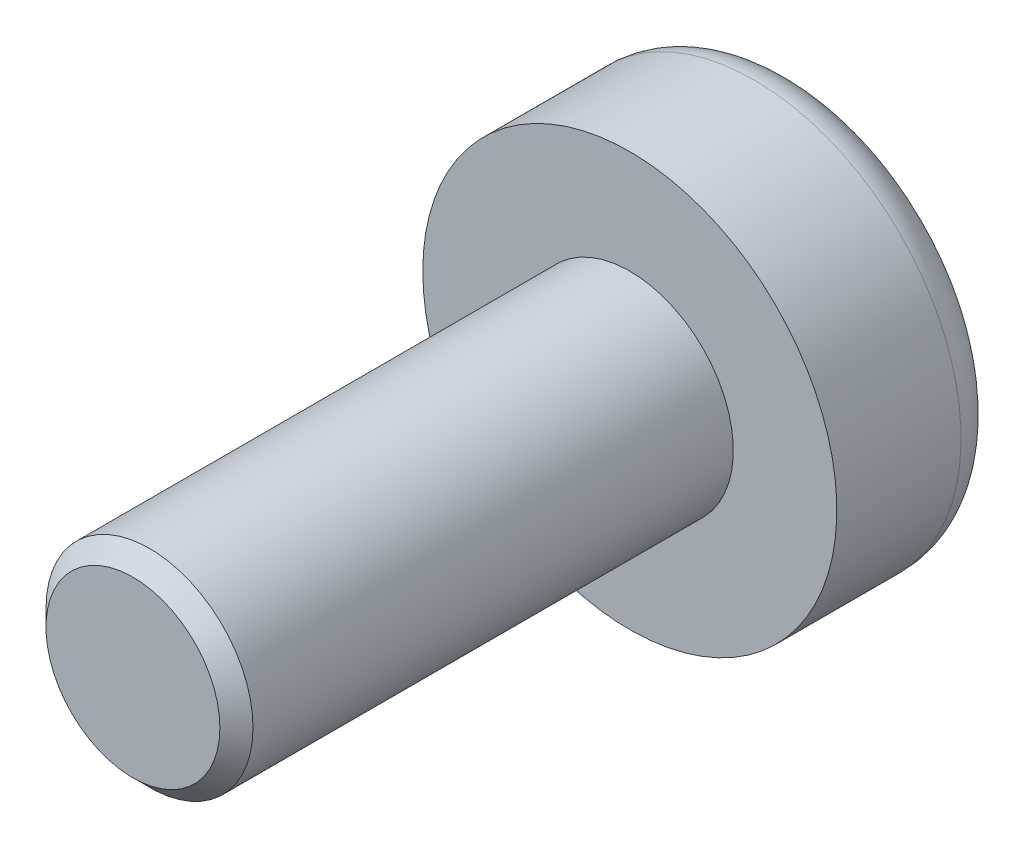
ISO-10303-21;
HEADER;
FILE_DESCRIPTION(('STEP AP214'),'2;1');
FILE_NAME('part.step','',(''),(''),'','','');
FILE_SCHEMA(('AUTOMOTIVE_DESIGN { 1 0 10303 214 1 1 1 1 }'));
ENDSEC;
DATA;
#1=APPLICATION_CONTEXT('core data for automotive mechanical design processes');
#2=APPLICATION_PROTOCOL_DEFINITION('international standard','automotive_design',2000,#1);
#3=PRODUCT_CONTEXT('',#1,'mechanical');
#4=PRODUCT('Part','Part','',(#3));
#5=PRODUCT_RELATED_PRODUCT_CATEGORY('part','',(#4));
#6=PRODUCT_DEFINITION_FORMATION('','',#4);
#7=PRODUCT_DEFINITION_CONTEXT('part definition',#1,'design');
#8=PRODUCT_DEFINITION('design','',#6,#7);
#9=PRODUCT_DEFINITION_SHAPE('','',#8);
#10=(LENGTH_UNIT() NAMED_UNIT(*) SI_UNIT(.MILLI.,.METRE.));
#11=(NAMED_UNIT(*) PLANE_ANGLE_UNIT() SI_UNIT($,.RADIAN.));
#12=(NAMED_UNIT(*) SI_UNIT($,.STERADIAN.) SOLID_ANGLE_UNIT());
#13=UNCERTAINTY_MEASURE_WITH_UNIT(LENGTH_MEASURE(1.E-05),#10,'distance_accuracy_value','');
#14=(GEOMETRIC_REPRESENTATION_CONTEXT(3) GLOBAL_UNCERTAINTY_ASSIGNED_CONTEXT((#13)) GLOBAL_UNIT_ASSIGNED_CONTEXT((#10,
#11,#12)) REPRESENTATION_CONTEXT('',''));
#15=CARTESIAN_POINT('',(0.,0.,0.));
#16=DIRECTION('',(0.,0.,1.));
#17=DIRECTION('',(1.,0.,0.));
#18=AXIS2_PLACEMENT_3D('',#15,#16,#17);
#19=CARTESIAN_POINT('',(0.,0.,6.));
#20=DIRECTION('',(0.,0.,-1.));
#21=DIRECTION('',(-1.,0.,0.));
#22=AXIS2_PLACEMENT_3D('',#19,#20,#21);
#23=CYLINDRICAL_SURFACE('',#22,1.25);
#24=CARTESIAN_POINT('',(0.,0.,5.8));
#25=DIRECTION('',(0.,0.,1.));
#26=DIRECTION('',(1.,0.,0.));
#27=AXIS2_PLACEMENT_3D('',#24,#25,#26);
#28=CIRCLE('',#27,1.25);
#29=CARTESIAN_POINT('',(1.25,0.,5.8));
#30=VERTEX_POINT('',#29);
#31=EDGE_CURVE('E228',#30,#30,#28,.F.);
#32=ORIENTED_EDGE('',*,*,#31,.T.);
#33=EDGE_LOOP('',(#32));
#34=FACE_BOUND('',#33,.T.);
#35=CARTESIAN_POINT('',(0.,0.,0.));
#36=DIRECTION('',(0.,0.,-1.));
#37=DIRECTION('',(-1.,0.,0.));
#38=AXIS2_PLACEMENT_3D('',#35,#36,#37);
#39=CIRCLE('',#38,1.25);
#40=CARTESIAN_POINT('',(-1.25,0.,0.));
#41=VERTEX_POINT('',#40);
#42=EDGE_CURVE('E222',#41,#41,#39,.T.);
#43=ORIENTED_EDGE('',*,*,#42,.F.);
#44=EDGE_LOOP('',(#43));
#45=FACE_BOUND('',#44,.T.);
#46=ADVANCED_FACE('F27',(#34,#45),#23,.T.);
#47=CARTESIAN_POINT('',(0.,0.,6.));
#48=DIRECTION('',(0.,0.,1.));
#49=DIRECTION('',(1.,0.,0.));
#50=AXIS2_PLACEMENT_3D('',#47,#48,#49);
#51=PLANE('',#50);
#52=CARTESIAN_POINT('',(0.,0.,6.));
#53=DIRECTION('',(0.,0.,1.));
#54=DIRECTION('',(1.,0.,0.));
#55=AXIS2_PLACEMENT_3D('',#52,#53,#54);
#56=CIRCLE('',#55,1.05);
#57=CARTESIAN_POINT('',(1.05,0.,6.));
#58=VERTEX_POINT('',#57);
#59=EDGE_CURVE('E225',#58,#58,#56,.T.);
#60=ORIENTED_EDGE('',*,*,#59,.T.);
#61=EDGE_LOOP('',(#60));
#62=FACE_BOUND('',#61,.T.);
#63=ADVANCED_FACE('F250',(#62),#51,.T.);
#64=CARTESIAN_POINT('',(0.,0.,6.));
#65=DIRECTION('',(0.,0.,-1.));
#66=DIRECTION('',(-1.,0.,0.));
#67=AXIS2_PLACEMENT_3D('',#64,#65,#66);
#68=CONICAL_SURFACE('',#67,1.05,0.785398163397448);
#69=ORIENTED_EDGE('',*,*,#31,.F.);
#70=EDGE_LOOP('',(#69));
#71=FACE_BOUND('',#70,.T.);
#72=ORIENTED_EDGE('',*,*,#59,.F.);
#73=EDGE_LOOP('',(#72));
#74=FACE_BOUND('',#73,.T.);
#75=ADVANCED_FACE('F255',(#71,#74),#68,.T.);
#76=CARTESIAN_POINT('',(0.,0.,0.));
#77=DIRECTION('',(0.,0.,-1.));
#78=DIRECTION('',(-1.,0.,0.));
#79=AXIS2_PLACEMENT_3D('',#76,#77,#78);
#80=PLANE('',#79);
#81=CARTESIAN_POINT('',(0.,0.,0.));
#82=DIRECTION('',(0.,0.,-1.));
#83=DIRECTION('',(-1.,0.,0.));
#84=AXIS2_PLACEMENT_3D('',#81,#82,#83);
#85=CIRCLE('',#84,2.5);
#86=CARTESIAN_POINT('',(-2.5,0.,0.));
#87=VERTEX_POINT('',#86);
#88=EDGE_CURVE('E201',#87,#87,#85,.T.);
#89=ORIENTED_EDGE('',*,*,#88,.F.);
#90=EDGE_LOOP('',(#89));
#91=FACE_BOUND('',#90,.T.);
#92=ORIENTED_EDGE('',*,*,#42,.T.);
#93=EDGE_LOOP('',(#92));
#94=FACE_BOUND('',#93,.T.);
#95=ADVANCED_FACE('F261',(#91,#94),#80,.F.);
#96=CARTESIAN_POINT('',(0.,0.,-2.));
#97=DIRECTION('',(0.,0.,1.));
#98=DIRECTION('',(1.,0.,0.));
#99=AXIS2_PLACEMENT_3D('',#96,#97,#98);
#100=CYLINDRICAL_SURFACE('',#99,2.5);
#101=CARTESIAN_POINT('',(0.,0.,-1.5));
#102=DIRECTION('',(0.,0.,-1.));
#103=DIRECTION('',(-1.,0.,0.));
#104=AXIS2_PLACEMENT_3D('',#101,#102,#103);
#105=CIRCLE('',#104,2.5);
#106=CARTESIAN_POINT('',(-2.5,0.,-1.5));
#107=VERTEX_POINT('',#106);
#108=EDGE_CURVE('E11',#107,#107,#105,.F.);
#109=ORIENTED_EDGE('',*,*,#108,.T.);
#110=EDGE_LOOP('',(#109));
#111=FACE_BOUND('',#110,.T.);
#112=ORIENTED_EDGE('',*,*,#88,.T.);
#113=EDGE_LOOP('',(#112));
#114=FACE_BOUND('',#113,.T.);
#115=ADVANCED_FACE('F245',(#111,#114),#100,.T.);
#116=CARTESIAN_POINT('',(0.,0.,-2.));
#117=DIRECTION('',(0.,0.,-1.));
#118=DIRECTION('',(-1.,0.,0.));
#119=AXIS2_PLACEMENT_3D('',#116,#117,#118);
#120=PLANE('',#119);
#121=DIRECTION('',(0.,-1.,0.));
#122=VECTOR('',#121,1.);
#123=CARTESIAN_POINT('',(0.2061337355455,1.04072398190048,-2.));
#124=LINE('',#123,#122);
#125=CARTESIAN_POINT('',(0.2061337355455,1.04072398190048,-2.));
#126=VERTEX_POINT('',#125);
#127=CARTESIAN_POINT('',(0.2061337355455,0.206133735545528,-2.));
#128=VERTEX_POINT('',#127);
#129=EDGE_CURVE('E41',#126,#128,#124,.T.);
#130=ORIENTED_EDGE('',*,*,#129,.F.);
#131=DIRECTION('',(1.,0.,0.));
#132=VECTOR('',#131,1.);
#133=CARTESIAN_POINT('',(0.2061337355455,1.04072398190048,-2.));
#134=LINE('',#133,#132);
#135=CARTESIAN_POINT('',(-0.2061337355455,1.04072398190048,-2.));
#136=VERTEX_POINT('',#135);
#137=EDGE_CURVE('E165',#136,#126,#134,.T.);
#138=ORIENTED_EDGE('',*,*,#137,.F.);
#139=DIRECTION('',(0.,1.,0.));
#140=VECTOR('',#139,1.);
#141=CARTESIAN_POINT('',(-0.2061337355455,1.04072398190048,-2.));
#142=LINE('',#141,#140);
#143=CARTESIAN_POINT('',(-0.2061337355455,0.206133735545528,-2.));
#144=VERTEX_POINT('',#143);
#145=EDGE_CURVE('E162',#144,#136,#142,.T.);
#146=ORIENTED_EDGE('',*,*,#145,.F.);
#147=DIRECTION('',(1.,0.,0.));
#148=VECTOR('',#147,1.);
#149=CARTESIAN_POINT('',(-1.12116641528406,0.206133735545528,-2.));
#150=LINE('',#149,#148);
#151=CARTESIAN_POINT('',(-1.12116641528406,0.206133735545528,-2.));
#152=VERTEX_POINT('',#151);
#153=EDGE_CURVE('E159',#152,#144,#150,.T.);
#154=ORIENTED_EDGE('',*,*,#153,.F.);
#155=DIRECTION('',(0.,1.,0.));
#156=VECTOR('',#155,1.);
#157=CARTESIAN_POINT('',(-1.12116641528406,0.206133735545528,-2.));
#158=LINE('',#157,#156);
#159=CARTESIAN_POINT('',(-1.12116641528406,-0.216189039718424,-2.));
#160=VERTEX_POINT('',#159);
#161=EDGE_CURVE('E156',#160,#152,#158,.T.);
#162=ORIENTED_EDGE('',*,*,#161,.F.);
#163=DIRECTION('',(-1.,0.,0.));
#164=VECTOR('',#163,1.);
#165=CARTESIAN_POINT('',(-1.12116641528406,-0.216189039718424,-2.));
#166=LINE('',#165,#164);
#167=CARTESIAN_POINT('',(-0.2061337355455,-0.216189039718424,-2.));
#168=VERTEX_POINT('',#167);
#169=EDGE_CURVE('E153',#168,#160,#166,.T.);
#170=ORIENTED_EDGE('',*,*,#169,.F.);
#171=DIRECTION('',(0.,1.,0.));
#172=VECTOR('',#171,1.);
#173=CARTESIAN_POINT('',(-0.2061337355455,-0.216189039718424,-2.));
#174=LINE('',#173,#172);
#175=CARTESIAN_POINT('',(-0.2061337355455,-1.13122171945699,-2.));
#176=VERTEX_POINT('',#175);
#177=EDGE_CURVE('E150',#176,#168,#174,.T.);
#178=ORIENTED_EDGE('',*,*,#177,.F.);
#179=DIRECTION('',(-1.,0.,0.));
#180=VECTOR('',#179,1.);
#181=CARTESIAN_POINT('',(0.2061337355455,-1.13122171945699,-2.));
#182=LINE('',#181,#180);
#183=CARTESIAN_POINT('',(0.2061337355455,-1.13122171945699,-2.));
#184=VERTEX_POINT('',#183);
#185=EDGE_CURVE('E147',#184,#176,#182,.T.);
#186=ORIENTED_EDGE('',*,*,#185,.F.);
#187=DIRECTION('',(0.,-1.,0.));
#188=VECTOR('',#187,1.);
#189=CARTESIAN_POINT('',(0.2061337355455,-0.216189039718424,-2.));
#190=LINE('',#189,#188);
#191=CARTESIAN_POINT('',(0.2061337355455,-0.216189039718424,-2.));
#192=VERTEX_POINT('',#191);
#193=EDGE_CURVE('E141',#192,#184,#190,.T.);
#194=ORIENTED_EDGE('',*,*,#193,.F.);
#195=DIRECTION('',(-1.,0.,0.));
#196=VECTOR('',#195,1.);
#197=CARTESIAN_POINT('',(1.17144293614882,-0.216189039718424,-2.));
#198=LINE('',#197,#196);
#199=CARTESIAN_POINT('',(1.17144293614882,-0.216189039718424,-2.));
#200=VERTEX_POINT('',#199);
#201=EDGE_CURVE('E139',#200,#192,#198,.T.);
#202=ORIENTED_EDGE('',*,*,#201,.F.);
#203=DIRECTION('',(0.,-1.,0.));
#204=VECTOR('',#203,1.);
#205=CARTESIAN_POINT('',(1.17144293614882,0.206133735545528,-2.));
#206=LINE('',#205,#204);
#207=CARTESIAN_POINT('',(1.17144293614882,0.206133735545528,-2.));
#208=VERTEX_POINT('',#207);
#209=EDGE_CURVE('E120',#208,#200,#206,.T.);
#210=ORIENTED_EDGE('',*,*,#209,.F.);
#211=DIRECTION('',(1.,0.,0.));
#212=VECTOR('',#211,1.);
#213=CARTESIAN_POINT('',(1.17144293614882,0.206133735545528,-2.));
#214=LINE('',#213,#212);
#215=EDGE_CURVE('E131',#128,#208,#214,.T.);
#216=ORIENTED_EDGE('',*,*,#215,.F.);
#217=EDGE_LOOP('',(#130,#138,#146,#154,#162,#170,#178,#186,#194,#202,#210,#216));
#218=FACE_BOUND('',#217,.T.);
#219=CARTESIAN_POINT('',(0.,0.,-2.));
#220=DIRECTION('',(0.,0.,-1.));
#221=DIRECTION('',(-1.,0.,0.));
#222=AXIS2_PLACEMENT_3D('',#219,#220,#221);
#223=CIRCLE('',#222,2.);
#224=CARTESIAN_POINT('',(-2.,0.,-2.));
#225=VERTEX_POINT('',#224);
#226=EDGE_CURVE('E34',#225,#225,#223,.T.);
#227=ORIENTED_EDGE('',*,*,#226,.T.);
#228=EDGE_LOOP('',(#227));
#229=FACE_BOUND('',#228,.T.);
#230=ADVANCED_FACE('F135',(#218,#229),#120,.T.);
#231=CARTESIAN_POINT('',(0.,0.,-1.5));
#232=DIRECTION('',(0.,0.,-1.));
#233=DIRECTION('',(-1.,0.,0.));
#234=AXIS2_PLACEMENT_3D('',#231,#232,#233);
#235=TOROIDAL_SURFACE('',#234,2.,0.5);
#236=ORIENTED_EDGE('',*,*,#108,.F.);
#237=EDGE_LOOP('',(#236));
#238=FACE_BOUND('',#237,.T.);
#239=ORIENTED_EDGE('',*,*,#226,.F.);
#240=EDGE_LOOP('',(#239));
#241=FACE_BOUND('',#240,.T.);
#242=ADVANCED_FACE('F233',(#238,#241),#235,.T.);
#243=CARTESIAN_POINT('',(0.2061337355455,1.04072398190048,-1.5));
#244=DIRECTION('',(1.,0.,0.));
#245=DIRECTION('',(0.,0.,-1.));
#246=AXIS2_PLACEMENT_3D('',#243,#244,#245);
#247=PLANE('',#246);
#248=ORIENTED_EDGE('',*,*,#129,.T.);
#249=DIRECTION('',(0.,0.,-1.));
#250=VECTOR('',#249,1.);
#251=CARTESIAN_POINT('',(0.2061337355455,0.206133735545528,-1.5));
#252=LINE('',#251,#250);
#253=CARTESIAN_POINT('',(0.2061337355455,0.206133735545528,-1.5));
#254=VERTEX_POINT('',#253);
#255=EDGE_CURVE('E128',#254,#128,#252,.T.);
#256=ORIENTED_EDGE('',*,*,#255,.F.);
#257=DIRECTION('',(0.,-1.,0.));
#258=VECTOR('',#257,1.);
#259=CARTESIAN_POINT('',(0.2061337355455,1.04072398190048,-1.5));
#260=LINE('',#259,#258);
#261=CARTESIAN_POINT('',(0.2061337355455,1.04072398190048,-1.5));
#262=VERTEX_POINT('',#261);
#263=EDGE_CURVE('E167',#262,#254,#260,.T.);
#264=ORIENTED_EDGE('',*,*,#263,.F.);
#265=DIRECTION('',(0.,0.,-1.));
#266=VECTOR('',#265,1.);
#267=CARTESIAN_POINT('',(0.2061337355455,1.04072398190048,-1.5));
#268=LINE('',#267,#266);
#269=EDGE_CURVE('E48',#262,#126,#268,.T.);
#270=ORIENTED_EDGE('',*,*,#269,.T.);
#271=EDGE_LOOP('',(#248,#256,#264,#270));
#272=FACE_BOUND('',#271,.T.);
#273=ADVANCED_FACE('F235',(#272),#247,.F.);
#274=CARTESIAN_POINT('',(0.2061337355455,1.04072398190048,-1.5));
#275=DIRECTION('',(0.,1.,0.));
#276=DIRECTION('',(0.,0.,1.));
#277=AXIS2_PLACEMENT_3D('',#274,#275,#276);
#278=PLANE('',#277);
#279=ORIENTED_EDGE('',*,*,#137,.T.);
#280=ORIENTED_EDGE('',*,*,#269,.F.);
#281=DIRECTION('',(1.,0.,0.));
#282=VECTOR('',#281,1.);
#283=CARTESIAN_POINT('',(0.2061337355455,1.04072398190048,-1.5));
#284=LINE('',#283,#282);
#285=CARTESIAN_POINT('',(-0.2061337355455,1.04072398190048,-1.5));
#286=VERTEX_POINT('',#285);
#287=EDGE_CURVE('E197',#286,#262,#284,.T.);
#288=ORIENTED_EDGE('',*,*,#287,.F.);
#289=DIRECTION('',(0.,0.,-1.));
#290=VECTOR('',#289,1.);
#291=CARTESIAN_POINT('',(-0.2061337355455,1.04072398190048,-1.5));
#292=LINE('',#291,#290);
#293=EDGE_CURVE('E202',#286,#136,#292,.T.);
#294=ORIENTED_EDGE('',*,*,#293,.T.);
#295=EDGE_LOOP('',(#279,#280,#288,#294));
#296=FACE_BOUND('',#295,.T.);
#297=ADVANCED_FACE('F243',(#296),#278,.F.);
#298=CARTESIAN_POINT('',(-0.2061337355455,1.04072398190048,-1.5));
#299=DIRECTION('',(-1.,0.,0.));
#300=DIRECTION('',(0.,0.,1.));
#301=AXIS2_PLACEMENT_3D('',#298,#299,#300);
#302=PLANE('',#301);
#303=ORIENTED_EDGE('',*,*,#145,.T.);
#304=ORIENTED_EDGE('',*,*,#293,.F.);
#305=DIRECTION('',(0.,1.,0.));
#306=VECTOR('',#305,1.);
#307=CARTESIAN_POINT('',(-0.2061337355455,1.04072398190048,-1.5));
#308=LINE('',#307,#306);
#309=CARTESIAN_POINT('',(-0.2061337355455,0.206133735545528,-1.5));
#310=VERTEX_POINT('',#309);
#311=EDGE_CURVE('E194',#310,#286,#308,.T.);
#312=ORIENTED_EDGE('',*,*,#311,.F.);
#313=DIRECTION('',(0.,0.,-1.));
#314=VECTOR('',#313,1.);
#315=CARTESIAN_POINT('',(-0.2061337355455,0.206133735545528,-1.5));
#316=LINE('',#315,#314);
#317=EDGE_CURVE('E204',#310,#144,#316,.T.);
#318=ORIENTED_EDGE('',*,*,#317,.T.);
#319=EDGE_LOOP('',(#303,#304,#312,#318));
#320=FACE_BOUND('',#319,.T.);
#321=ADVANCED_FACE('F306',(#320),#302,.F.);
#322=CARTESIAN_POINT('',(-1.12116641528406,0.206133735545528,-1.5));
#323=DIRECTION('',(0.,1.,0.));
#324=DIRECTION('',(-1.,0.,0.));
#325=AXIS2_PLACEMENT_3D('',#322,#323,#324);
#326=PLANE('',#325);
#327=ORIENTED_EDGE('',*,*,#153,.T.);
#328=ORIENTED_EDGE('',*,*,#317,.F.);
#329=DIRECTION('',(1.,0.,0.));
#330=VECTOR('',#329,1.);
#331=CARTESIAN_POINT('',(-1.12116641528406,0.206133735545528,-1.5));
#332=LINE('',#331,#330);
#333=CARTESIAN_POINT('',(-1.12116641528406,0.206133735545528,-1.5));
#334=VERTEX_POINT('',#333);
#335=EDGE_CURVE('E191',#334,#310,#332,.T.);
#336=ORIENTED_EDGE('',*,*,#335,.F.);
#337=DIRECTION('',(0.,0.,-1.));
#338=VECTOR('',#337,1.);
#339=CARTESIAN_POINT('',(-1.12116641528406,0.206133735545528,-1.5));
#340=LINE('',#339,#338);
#341=EDGE_CURVE('E206',#334,#152,#340,.T.);
#342=ORIENTED_EDGE('',*,*,#341,.T.);
#343=EDGE_LOOP('',(#327,#328,#336,#342));
#344=FACE_BOUND('',#343,.T.);
#345=ADVANCED_FACE('F313',(#344),#326,.F.);
#346=CARTESIAN_POINT('',(-1.12116641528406,0.206133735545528,-1.5));
#347=DIRECTION('',(-1.,0.,0.));
#348=DIRECTION('',(0.,0.,1.));
#349=AXIS2_PLACEMENT_3D('',#346,#347,#348);
#350=PLANE('',#349);
#351=ORIENTED_EDGE('',*,*,#161,.T.);
#352=ORIENTED_EDGE('',*,*,#341,.F.);
#353=DIRECTION('',(0.,1.,0.));
#354=VECTOR('',#353,1.);
#355=CARTESIAN_POINT('',(-1.12116641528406,0.206133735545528,-1.5));
#356=LINE('',#355,#354);
#357=CARTESIAN_POINT('',(-1.12116641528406,-0.216189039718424,-1.5));
#358=VERTEX_POINT('',#357);
#359=EDGE_CURVE('E188',#358,#334,#356,.T.);
#360=ORIENTED_EDGE('',*,*,#359,.F.);
#361=DIRECTION('',(0.,0.,-1.));
#362=VECTOR('',#361,1.);
#363=CARTESIAN_POINT('',(-1.12116641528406,-0.216189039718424,-1.5));
#364=LINE('',#363,#362);
#365=EDGE_CURVE('E208',#358,#160,#364,.T.);
#366=ORIENTED_EDGE('',*,*,#365,.T.);
#367=EDGE_LOOP('',(#351,#352,#360,#366));
#368=FACE_BOUND('',#367,.T.);
#369=ADVANCED_FACE('F321',(#368),#350,.F.);
#370=CARTESIAN_POINT('',(-1.12116641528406,-0.216189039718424,-1.5));
#371=DIRECTION('',(0.,-1.,0.));
#372=DIRECTION('',(1.,0.,0.));
#373=AXIS2_PLACEMENT_3D('',#370,#371,#372);
#374=PLANE('',#373);
#375=ORIENTED_EDGE('',*,*,#169,.T.);
#376=ORIENTED_EDGE('',*,*,#365,.F.);
#377=DIRECTION('',(-1.,0.,0.));
#378=VECTOR('',#377,1.);
#379=CARTESIAN_POINT('',(-1.12116641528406,-0.216189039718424,-1.5));
#380=LINE('',#379,#378);
#381=CARTESIAN_POINT('',(-0.2061337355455,-0.216189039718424,-1.5));
#382=VERTEX_POINT('',#381);
#383=EDGE_CURVE('E185',#382,#358,#380,.T.);
#384=ORIENTED_EDGE('',*,*,#383,.F.);
#385=DIRECTION('',(0.,0.,-1.));
#386=VECTOR('',#385,1.);
#387=CARTESIAN_POINT('',(-0.2061337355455,-0.216189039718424,-1.5));
#388=LINE('',#387,#386);
#389=EDGE_CURVE('E210',#382,#168,#388,.T.);
#390=ORIENTED_EDGE('',*,*,#389,.T.);
#391=EDGE_LOOP('',(#375,#376,#384,#390));
#392=FACE_BOUND('',#391,.T.);
#393=ADVANCED_FACE('F329',(#392),#374,.F.);
#394=CARTESIAN_POINT('',(-0.2061337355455,-0.216189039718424,-1.5));
#395=DIRECTION('',(-1.,0.,0.));
#396=DIRECTION('',(0.,0.,1.));
#397=AXIS2_PLACEMENT_3D('',#394,#395,#396);
#398=PLANE('',#397);
#399=ORIENTED_EDGE('',*,*,#177,.T.);
#400=ORIENTED_EDGE('',*,*,#389,.F.);
#401=DIRECTION('',(0.,1.,0.));
#402=VECTOR('',#401,1.);
#403=CARTESIAN_POINT('',(-0.2061337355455,-0.216189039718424,-1.5));
#404=LINE('',#403,#402);
#405=CARTESIAN_POINT('',(-0.2061337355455,-1.13122171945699,-1.5));
#406=VERTEX_POINT('',#405);
#407=EDGE_CURVE('E182',#406,#382,#404,.T.);
#408=ORIENTED_EDGE('',*,*,#407,.F.);
#409=DIRECTION('',(0.,0.,-1.));
#410=VECTOR('',#409,1.);
#411=CARTESIAN_POINT('',(-0.2061337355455,-1.13122171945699,-1.5));
#412=LINE('',#411,#410);
#413=EDGE_CURVE('E212',#406,#176,#412,.T.);
#414=ORIENTED_EDGE('',*,*,#413,.T.);
#415=EDGE_LOOP('',(#399,#400,#408,#414));
#416=FACE_BOUND('',#415,.T.);
#417=ADVANCED_FACE('F337',(#416),#398,.F.);
#418=CARTESIAN_POINT('',(0.2061337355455,-1.13122171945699,-1.5));
#419=DIRECTION('',(0.,-1.,0.));
#420=DIRECTION('',(0.,0.,-1.));
#421=AXIS2_PLACEMENT_3D('',#418,#419,#420);
#422=PLANE('',#421);
#423=ORIENTED_EDGE('',*,*,#185,.T.);
#424=ORIENTED_EDGE('',*,*,#413,.F.);
#425=DIRECTION('',(-1.,0.,0.));
#426=VECTOR('',#425,1.);
#427=CARTESIAN_POINT('',(0.2061337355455,-1.13122171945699,-1.5));
#428=LINE('',#427,#426);
#429=CARTESIAN_POINT('',(0.2061337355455,-1.13122171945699,-1.5));
#430=VERTEX_POINT('',#429);
#431=EDGE_CURVE('E179',#430,#406,#428,.T.);
#432=ORIENTED_EDGE('',*,*,#431,.F.);
#433=DIRECTION('',(0.,0.,-1.));
#434=VECTOR('',#433,1.);
#435=CARTESIAN_POINT('',(0.2061337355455,-1.13122171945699,-1.5));
#436=LINE('',#435,#434);
#437=EDGE_CURVE('E214',#430,#184,#436,.T.);
#438=ORIENTED_EDGE('',*,*,#437,.T.);
#439=EDGE_LOOP('',(#423,#424,#432,#438));
#440=FACE_BOUND('',#439,.T.);
#441=ADVANCED_FACE('F345',(#440),#422,.F.);
#442=CARTESIAN_POINT('',(0.2061337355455,-0.216189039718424,-1.5));
#443=DIRECTION('',(1.,0.,0.));
#444=DIRECTION('',(0.,0.,-1.));
#445=AXIS2_PLACEMENT_3D('',#442,#443,#444);
#446=PLANE('',#445);
#447=ORIENTED_EDGE('',*,*,#193,.T.);
#448=ORIENTED_EDGE('',*,*,#437,.F.);
#449=DIRECTION('',(0.,-1.,0.));
#450=VECTOR('',#449,1.);
#451=CARTESIAN_POINT('',(0.2061337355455,-0.216189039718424,-1.5));
#452=LINE('',#451,#450);
#453=CARTESIAN_POINT('',(0.2061337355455,-0.216189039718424,-1.5));
#454=VERTEX_POINT('',#453);
#455=EDGE_CURVE('E176',#454,#430,#452,.T.);
#456=ORIENTED_EDGE('',*,*,#455,.F.);
#457=DIRECTION('',(0.,0.,-1.));
#458=VECTOR('',#457,1.);
#459=CARTESIAN_POINT('',(0.2061337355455,-0.216189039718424,-1.5));
#460=LINE('',#459,#458);
#461=EDGE_CURVE('E216',#454,#192,#460,.T.);
#462=ORIENTED_EDGE('',*,*,#461,.T.);
#463=EDGE_LOOP('',(#447,#448,#456,#462));
#464=FACE_BOUND('',#463,.T.);
#465=ADVANCED_FACE('F353',(#464),#446,.F.);
#466=CARTESIAN_POINT('',(1.17144293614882,-0.216189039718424,-1.5));
#467=DIRECTION('',(0.,-1.,0.));
#468=DIRECTION('',(1.,0.,0.));
#469=AXIS2_PLACEMENT_3D('',#466,#467,#468);
#470=PLANE('',#469);
#471=ORIENTED_EDGE('',*,*,#201,.T.);
#472=ORIENTED_EDGE('',*,*,#461,.F.);
#473=DIRECTION('',(-1.,0.,0.));
#474=VECTOR('',#473,1.);
#475=CARTESIAN_POINT('',(1.17144293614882,-0.216189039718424,-1.5));
#476=LINE('',#475,#474);
#477=CARTESIAN_POINT('',(1.17144293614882,-0.216189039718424,-1.5));
#478=VERTEX_POINT('',#477);
#479=EDGE_CURVE('E173',#478,#454,#476,.T.);
#480=ORIENTED_EDGE('',*,*,#479,.F.);
#481=DIRECTION('',(0.,0.,-1.));
#482=VECTOR('',#481,1.);
#483=CARTESIAN_POINT('',(1.17144293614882,-0.216189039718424,-1.5));
#484=LINE('',#483,#482);
#485=EDGE_CURVE('E127',#478,#200,#484,.T.);
#486=ORIENTED_EDGE('',*,*,#485,.T.);
#487=EDGE_LOOP('',(#471,#472,#480,#486));
#488=FACE_BOUND('',#487,.T.);
#489=ADVANCED_FACE('F361',(#488),#470,.F.);
#490=CARTESIAN_POINT('',(1.17144293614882,0.206133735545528,-1.5));
#491=DIRECTION('',(1.,0.,0.));
#492=DIRECTION('',(0.,0.,-1.));
#493=AXIS2_PLACEMENT_3D('',#490,#491,#492);
#494=PLANE('',#493);
#495=ORIENTED_EDGE('',*,*,#209,.T.);
#496=ORIENTED_EDGE('',*,*,#485,.F.);
#497=DIRECTION('',(0.,-1.,0.));
#498=VECTOR('',#497,1.);
#499=CARTESIAN_POINT('',(1.17144293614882,0.206133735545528,-1.5));
#500=LINE('',#499,#498);
#501=CARTESIAN_POINT('',(1.17144293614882,0.206133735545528,-1.5));
#502=VERTEX_POINT('',#501);
#503=EDGE_CURVE('E123',#502,#478,#500,.T.);
#504=ORIENTED_EDGE('',*,*,#503,.F.);
#505=DIRECTION('',(0.,0.,-1.));
#506=VECTOR('',#505,1.);
#507=CARTESIAN_POINT('',(1.17144293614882,0.206133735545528,-1.5));
#508=LINE('',#507,#506);
#509=EDGE_CURVE('E116',#502,#208,#508,.T.);
#510=ORIENTED_EDGE('',*,*,#509,.T.);
#511=EDGE_LOOP('',(#495,#496,#504,#510));
#512=FACE_BOUND('',#511,.T.);
#513=ADVANCED_FACE('F118',(#512),#494,.F.);
#514=CARTESIAN_POINT('',(1.17144293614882,0.206133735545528,-1.5));
#515=DIRECTION('',(0.,1.,0.));
#516=DIRECTION('',(-1.,0.,0.));
#517=AXIS2_PLACEMENT_3D('',#514,#515,#516);
#518=PLANE('',#517);
#519=ORIENTED_EDGE('',*,*,#215,.T.);
#520=ORIENTED_EDGE('',*,*,#509,.F.);
#521=DIRECTION('',(1.,0.,0.));
#522=VECTOR('',#521,1.);
#523=CARTESIAN_POINT('',(1.17144293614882,0.206133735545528,-1.5));
#524=LINE('',#523,#522);
#525=EDGE_CURVE('E170',#254,#502,#524,.T.);
#526=ORIENTED_EDGE('',*,*,#525,.F.);
#527=ORIENTED_EDGE('',*,*,#255,.T.);
#528=EDGE_LOOP('',(#519,#520,#526,#527));
#529=FACE_BOUND('',#528,.T.);
#530=ADVANCED_FACE('F132',(#529),#518,.F.);
#531=CARTESIAN_POINT('',(0.2061337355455,-1.13122171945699,-1.5));
#532=DIRECTION('',(0.,0.,-1.));
#533=DIRECTION('',(-1.,0.,0.));
#534=AXIS2_PLACEMENT_3D('',#531,#532,#533);
#535=PLANE('',#534);
#536=ORIENTED_EDGE('',*,*,#263,.T.);
#537=ORIENTED_EDGE('',*,*,#525,.T.);
#538=ORIENTED_EDGE('',*,*,#503,.T.);
#539=ORIENTED_EDGE('',*,*,#479,.T.);
#540=ORIENTED_EDGE('',*,*,#455,.T.);
#541=ORIENTED_EDGE('',*,*,#431,.T.);
#542=ORIENTED_EDGE('',*,*,#407,.T.);
#543=ORIENTED_EDGE('',*,*,#383,.T.);
#544=ORIENTED_EDGE('',*,*,#359,.T.);
#545=ORIENTED_EDGE('',*,*,#335,.T.);
#546=ORIENTED_EDGE('',*,*,#311,.T.);
#547=ORIENTED_EDGE('',*,*,#287,.T.);
#548=EDGE_LOOP('',(#536,#537,#538,#539,#540,#541,#542,#543,#544,#545,#546,#547));
#549=FACE_BOUND('',#548,.T.);
#550=ADVANCED_FACE('F382',(#549),#535,.T.);
#551=CLOSED_SHELL('',(#46,#63,#75,#95,#115,#230,#242,#273,#297,#321,#345,#369,#393,#417,#441,
#465,#489,#513,#530,#550));
#552=MANIFOLD_SOLID_BREP('B2',#551);
#553=ADVANCED_BREP_SHAPE_REPRESENTATION('',(#18,#552),#14);
#554=SHAPE_DEFINITION_REPRESENTATION(#9,#553);
ENDSEC;
END-ISO-10303-21;
